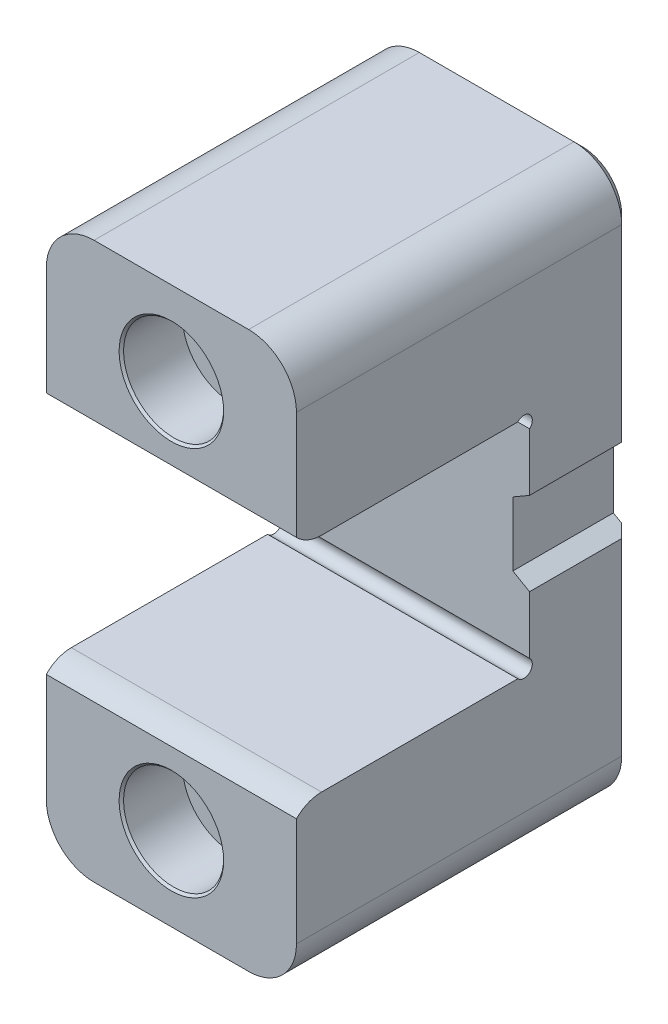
from build123d import *

# Parameters (mm, degrees)
EXTRUDE1_DEPTH                  = 22.5
FILLET1_R                       = 8.6
CUT_EXTRUDE1_DEPTH              = 86.382960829
CUT_EXTRUDE2_DEPTH              = 91.138781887
SKETCH6_R                       = 1.5
CUT_EXTRUDE3_DEPTH              = 91.138781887
CBORE_FOR_M10_SHCS1_D           = 11
CBORE_FOR_M10_SHCS1_CBORE_D     = 18
CBORE_FOR_M10_SHCS1_CBORE_DEPTH = 11
CHAMFER1_SIZE                   = 1.5
CHAMFER3_SIZE                   = 0.4


with BuildPart() as part:
    # Sketch1 → Extrude1 (new, symmetric)
    with BuildSketch(Plane(origin=(0, 0, 0), x_dir=(0, 0, -1), z_dir=(1, 0, 0))):
        Polygon((0, 20), (41.92, 20), (41.92, -20), (0, -20), (0, -50), (60, -50), (60, 50), (0, 50), align=None)
    extrude(amount=EXTRUDE1_DEPTH, both=True)

    # Fillet1
    fillet1_edges = [part.edges().sort_by_distance(p)[0] for p in [
        (22.5, -50, -30),
        (22.5, 50, -30),
        (-22.5, 50, -30),
        (-22.5, -50, -30),
    ]]
    fillet(fillet1_edges, radius=FILLET1_R)

    # Sketch2 → Cut-Extrude1 (cut, through all)
    with BuildSketch(Plane(origin=(-12, 0, 0), x_dir=(1, 0, 0), z_dir=(0, 0, 1))):
        Polygon((31.5, -5.767949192), (34.5, -7.5), (34.5, 7.5), (31.5, 5.767949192), align=None)
    extrude(amount=-CUT_EXTRUDE1_DEPTH, mode=Mode.SUBTRACT)

    # Sketch5 → Cut-Extrude2 (cut, through all)
    with BuildSketch(Plane(origin=(22.5, 0, 0), x_dir=(0, 0, -1), z_dir=(1, 0, 0))):
        with BuildLine():
            Line((-5.5, -11.916994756), (4.5, -11.916994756))
            Line((4.5, -11.916994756), (4.5, -20))
            ThreePointArc((4.5, -20), (2.054347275, -20.499217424), (0, -21.916994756))
            Line((0, -21.916994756), (-5.5, -21.916994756))
            Line((-5.5, -21.916994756), (-5.5, -11.916994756))
        make_face()
        with BuildLine():
            Line((4.5, 11.916994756), (4.5, 20))
            ThreePointArc((4.5, 20), (2.054347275, 20.499217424), (0, 21.916994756))
            Line((0, 21.916994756), (-5.5, 21.916994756))
            Line((-5.5, 21.916994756), (-5.5, 11.916994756))
            Line((-5.5, 11.916994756), (4.5, 11.916994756))
        make_face()
    extrude(amount=-CUT_EXTRUDE2_DEPTH, mode=Mode.SUBTRACT)

    # Sketch6 → Cut-Extrude3 (cut, through all)
    with BuildSketch(Plane(origin=(22.5, 0, 0), x_dir=(0, 0, -1), z_dir=(1, 0, 0))):
        with Locations((40.92, 19)):
            Circle(SKETCH6_R)
        with Locations((40.92, -19)):
            Circle(SKETCH6_R)
    extrude(amount=-CUT_EXTRUDE3_DEPTH, mode=Mode.SUBTRACT)

    # CBORE for M10 SHCS1 (through all)
    with Locations(Plane.XY):
        with Locations((0, 35), (0, -35)):
            CounterBoreHole(CBORE_FOR_M10_SHCS1_D / 2, CBORE_FOR_M10_SHCS1_CBORE_D / 2, CBORE_FOR_M10_SHCS1_CBORE_DEPTH)

    # Chamfer1
    chamfer1_edges = [part.edges().sort_by_distance(p)[0] for p in [
        (22.5, -24.45, -60),
        (-22.5, 0, -60),
        (0, 50, -60),
        (0, -50, -60),
        (-19.981118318, 47.481118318, -60),
        (-19.981118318, -47.481118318, -60),
        (19.981118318, 47.481118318, -60),
        (19.981118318, -47.481118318, -60),
        (22.5, 24.45, -60),
    ]]
    chamfer(chamfer1_edges, length=CHAMFER1_SIZE)

    # Chamfer3
    chamfer3_edges = [part.edges().sort_by_distance(p)[0] for p in [
        (-9, -35, 0),
        (-9, 35, 0),
    ]]
    chamfer(chamfer3_edges, length=CHAMFER3_SIZE)


solid = part.part
